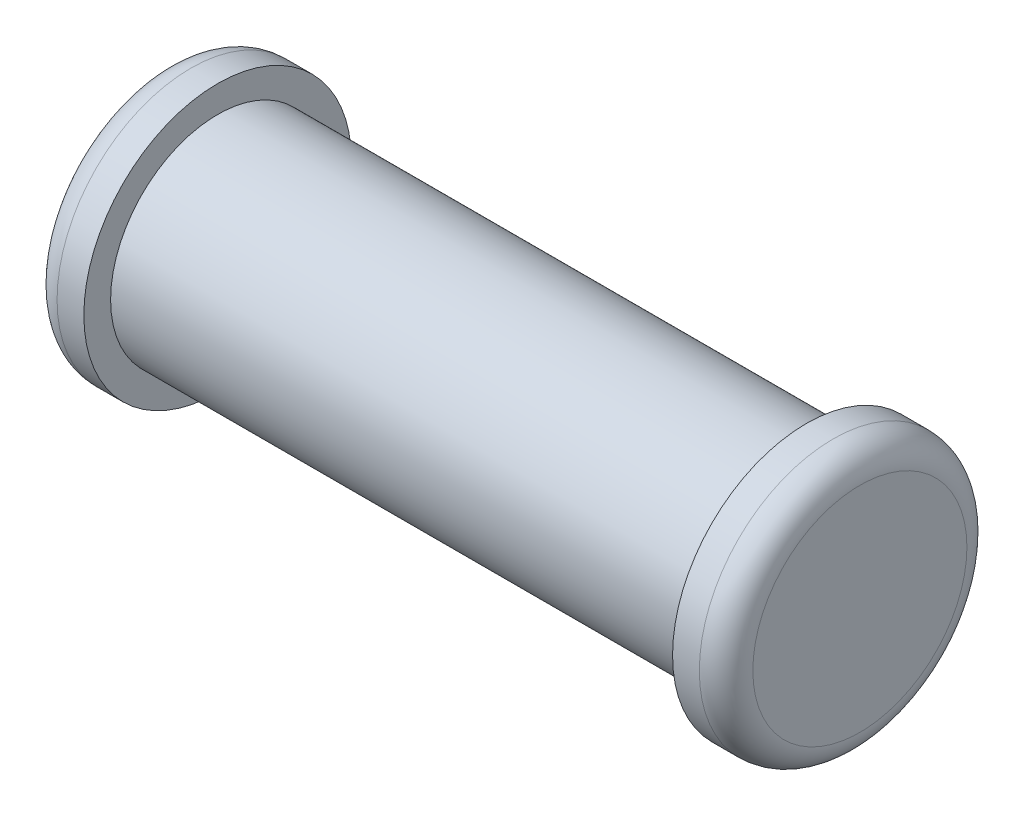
ISO-10303-21;
HEADER;
FILE_DESCRIPTION(('STEP AP214'),'2;1');
FILE_NAME('part.step','',(''),(''),'','','');
FILE_SCHEMA(('AUTOMOTIVE_DESIGN { 1 0 10303 214 1 1 1 1 }'));
ENDSEC;
DATA;
#1=APPLICATION_CONTEXT('core data for automotive mechanical design processes');
#2=APPLICATION_PROTOCOL_DEFINITION('international standard','automotive_design',2000,#1);
#3=PRODUCT_CONTEXT('',#1,'mechanical');
#4=PRODUCT('Part','Part','',(#3));
#5=PRODUCT_RELATED_PRODUCT_CATEGORY('part','',(#4));
#6=PRODUCT_DEFINITION_FORMATION('','',#4);
#7=PRODUCT_DEFINITION_CONTEXT('part definition',#1,'design');
#8=PRODUCT_DEFINITION('design','',#6,#7);
#9=PRODUCT_DEFINITION_SHAPE('','',#8);
#10=(LENGTH_UNIT() NAMED_UNIT(*) SI_UNIT(.MILLI.,.METRE.));
#11=(NAMED_UNIT(*) PLANE_ANGLE_UNIT() SI_UNIT($,.RADIAN.));
#12=(NAMED_UNIT(*) SI_UNIT($,.STERADIAN.) SOLID_ANGLE_UNIT());
#13=UNCERTAINTY_MEASURE_WITH_UNIT(LENGTH_MEASURE(1.E-05),#10,'distance_accuracy_value','');
#14=(GEOMETRIC_REPRESENTATION_CONTEXT(3) GLOBAL_UNCERTAINTY_ASSIGNED_CONTEXT((#13)) GLOBAL_UNIT_ASSIGNED_CONTEXT((#10,
#11,#12)) REPRESENTATION_CONTEXT('',''));
#15=CARTESIAN_POINT('',(0.,0.,0.));
#16=DIRECTION('',(0.,0.,1.));
#17=DIRECTION('',(1.,0.,0.));
#18=AXIS2_PLACEMENT_3D('',#15,#16,#17);
#19=CARTESIAN_POINT('',(11.,0.,0.));
#20=DIRECTION('',(-1.,0.,0.));
#21=DIRECTION('',(0.,0.,1.));
#22=AXIS2_PLACEMENT_3D('',#19,#20,#21);
#23=CYLINDRICAL_SURFACE('',#22,2.);
#24=CARTESIAN_POINT('',(11.,0.,0.));
#25=DIRECTION('',(1.,0.,0.));
#26=DIRECTION('',(0.,0.,-1.));
#27=AXIS2_PLACEMENT_3D('',#24,#25,#26);
#28=CIRCLE('',#27,2.);
#29=CARTESIAN_POINT('',(11.,0.,-2.));
#30=VERTEX_POINT('',#29);
#31=EDGE_CURVE('E61',#30,#30,#28,.T.);
#32=ORIENTED_EDGE('',*,*,#31,.F.);
#33=EDGE_LOOP('',(#32));
#34=FACE_BOUND('',#33,.T.);
#35=CARTESIAN_POINT('',(0.,0.,0.));
#36=DIRECTION('',(1.,0.,0.));
#37=DIRECTION('',(0.,0.,-1.));
#38=AXIS2_PLACEMENT_3D('',#35,#36,#37);
#39=CIRCLE('',#38,2.);
#40=CARTESIAN_POINT('',(0.,0.,-2.));
#41=VERTEX_POINT('',#40);
#42=EDGE_CURVE('E62',#41,#41,#39,.T.);
#43=ORIENTED_EDGE('',*,*,#42,.T.);
#44=EDGE_LOOP('',(#43));
#45=FACE_BOUND('',#44,.T.);
#46=ADVANCED_FACE('F41',(#34,#45),#23,.T.);
#47=CARTESIAN_POINT('',(-1.,0.,0.));
#48=DIRECTION('',(1.,0.,0.));
#49=DIRECTION('',(0.,0.,-1.));
#50=AXIS2_PLACEMENT_3D('',#47,#48,#49);
#51=CYLINDRICAL_SURFACE('',#50,2.5);
#52=CARTESIAN_POINT('',(-0.5,0.,0.));
#53=DIRECTION('',(-1.,0.,0.));
#54=DIRECTION('',(0.,0.,1.));
#55=AXIS2_PLACEMENT_3D('',#52,#53,#54);
#56=CIRCLE('',#55,2.5);
#57=CARTESIAN_POINT('',(-0.5,0.,2.5));
#58=VERTEX_POINT('',#57);
#59=EDGE_CURVE('E52',#58,#58,#56,.F.);
#60=ORIENTED_EDGE('',*,*,#59,.T.);
#61=EDGE_LOOP('',(#60));
#62=FACE_BOUND('',#61,.T.);
#63=CARTESIAN_POINT('',(0.,0.,0.));
#64=DIRECTION('',(-1.,0.,0.));
#65=DIRECTION('',(0.,0.,1.));
#66=AXIS2_PLACEMENT_3D('',#63,#64,#65);
#67=CIRCLE('',#66,2.5);
#68=CARTESIAN_POINT('',(0.,0.,2.5));
#69=VERTEX_POINT('',#68);
#70=EDGE_CURVE('E65',#69,#69,#67,.T.);
#71=ORIENTED_EDGE('',*,*,#70,.T.);
#72=EDGE_LOOP('',(#71));
#73=FACE_BOUND('',#72,.T.);
#74=ADVANCED_FACE('F91',(#62,#73),#51,.T.);
#75=CARTESIAN_POINT('',(-1.,0.,0.));
#76=DIRECTION('',(-1.,0.,0.));
#77=DIRECTION('',(0.,0.,1.));
#78=AXIS2_PLACEMENT_3D('',#75,#76,#77);
#79=PLANE('',#78);
#80=CARTESIAN_POINT('',(-1.,0.,0.));
#81=DIRECTION('',(-1.,0.,0.));
#82=DIRECTION('',(0.,0.,1.));
#83=AXIS2_PLACEMENT_3D('',#80,#81,#82);
#84=CIRCLE('',#83,2.);
#85=CARTESIAN_POINT('',(-1.,0.,2.));
#86=VERTEX_POINT('',#85);
#87=EDGE_CURVE('E56',#86,#86,#84,.T.);
#88=ORIENTED_EDGE('',*,*,#87,.T.);
#89=EDGE_LOOP('',(#88));
#90=FACE_BOUND('',#89,.T.);
#91=ADVANCED_FACE('F98',(#90),#79,.T.);
#92=CARTESIAN_POINT('',(0.,0.,0.));
#93=DIRECTION('',(-1.,0.,0.));
#94=DIRECTION('',(0.,0.,1.));
#95=AXIS2_PLACEMENT_3D('',#92,#93,#94);
#96=PLANE('',#95);
#97=ORIENTED_EDGE('',*,*,#42,.F.);
#98=EDGE_LOOP('',(#97));
#99=FACE_BOUND('',#98,.T.);
#100=ORIENTED_EDGE('',*,*,#70,.F.);
#101=EDGE_LOOP('',(#100));
#102=FACE_BOUND('',#101,.T.);
#103=ADVANCED_FACE('F86',(#99,#102),#96,.F.);
#104=CARTESIAN_POINT('',(-0.5,0.,0.));
#105=DIRECTION('',(-1.,0.,0.));
#106=DIRECTION('',(0.,0.,1.));
#107=AXIS2_PLACEMENT_3D('',#104,#105,#106);
#108=TOROIDAL_SURFACE('',#107,2.,0.5);
#109=ORIENTED_EDGE('',*,*,#59,.F.);
#110=EDGE_LOOP('',(#109));
#111=FACE_BOUND('',#110,.T.);
#112=ORIENTED_EDGE('',*,*,#87,.F.);
#113=EDGE_LOOP('',(#112));
#114=FACE_BOUND('',#113,.T.);
#115=ADVANCED_FACE('F79',(#111,#114),#108,.T.);
#116=CARTESIAN_POINT('',(12.,0.,0.));
#117=DIRECTION('',(-1.,0.,0.));
#118=DIRECTION('',(0.,0.,1.));
#119=AXIS2_PLACEMENT_3D('',#116,#117,#118);
#120=CYLINDRICAL_SURFACE('',#119,2.5);
#121=CARTESIAN_POINT('',(11.5,0.,0.));
#122=DIRECTION('',(1.,0.,0.));
#123=DIRECTION('',(0.,0.,-1.));
#124=AXIS2_PLACEMENT_3D('',#121,#122,#123);
#125=CIRCLE('',#124,2.5);
#126=CARTESIAN_POINT('',(11.5,0.,-2.5));
#127=VERTEX_POINT('',#126);
#128=EDGE_CURVE('E48',#127,#127,#125,.F.);
#129=ORIENTED_EDGE('',*,*,#128,.T.);
#130=EDGE_LOOP('',(#129));
#131=FACE_BOUND('',#130,.T.);
#132=CARTESIAN_POINT('',(11.,0.,0.));
#133=DIRECTION('',(-1.,0.,0.));
#134=DIRECTION('',(0.,0.,1.));
#135=AXIS2_PLACEMENT_3D('',#132,#133,#134);
#136=CIRCLE('',#135,2.5);
#137=CARTESIAN_POINT('',(11.,0.,2.5));
#138=VERTEX_POINT('',#137);
#139=EDGE_CURVE('E70',#138,#138,#136,.T.);
#140=ORIENTED_EDGE('',*,*,#139,.F.);
#141=EDGE_LOOP('',(#140));
#142=FACE_BOUND('',#141,.T.);
#143=ADVANCED_FACE('F76',(#131,#142),#120,.T.);
#144=CARTESIAN_POINT('',(12.,0.,0.));
#145=DIRECTION('',(1.,0.,0.));
#146=DIRECTION('',(0.,0.,1.));
#147=AXIS2_PLACEMENT_3D('',#144,#145,#146);
#148=PLANE('',#147);
#149=CARTESIAN_POINT('',(12.,0.,0.));
#150=DIRECTION('',(1.,0.,0.));
#151=DIRECTION('',(0.,0.,-1.));
#152=AXIS2_PLACEMENT_3D('',#149,#150,#151);
#153=CIRCLE('',#152,2.);
#154=CARTESIAN_POINT('',(12.,0.,-2.));
#155=VERTEX_POINT('',#154);
#156=EDGE_CURVE('E10',#155,#155,#153,.T.);
#157=ORIENTED_EDGE('',*,*,#156,.T.);
#158=EDGE_LOOP('',(#157));
#159=FACE_BOUND('',#158,.T.);
#160=ADVANCED_FACE('F78',(#159),#148,.T.);
#161=CARTESIAN_POINT('',(11.,0.,0.));
#162=DIRECTION('',(1.,0.,0.));
#163=DIRECTION('',(0.,0.,1.));
#164=AXIS2_PLACEMENT_3D('',#161,#162,#163);
#165=PLANE('',#164);
#166=ORIENTED_EDGE('',*,*,#31,.T.);
#167=EDGE_LOOP('',(#166));
#168=FACE_BOUND('',#167,.T.);
#169=ORIENTED_EDGE('',*,*,#139,.T.);
#170=EDGE_LOOP('',(#169));
#171=FACE_BOUND('',#170,.T.);
#172=ADVANCED_FACE('F74',(#168,#171),#165,.F.);
#173=CARTESIAN_POINT('',(11.5,0.,0.));
#174=DIRECTION('',(1.,0.,0.));
#175=DIRECTION('',(0.,0.,-1.));
#176=AXIS2_PLACEMENT_3D('',#173,#174,#175);
#177=TOROIDAL_SURFACE('',#176,2.,0.5);
#178=ORIENTED_EDGE('',*,*,#156,.F.);
#179=EDGE_LOOP('',(#178));
#180=FACE_BOUND('',#179,.T.);
#181=ORIENTED_EDGE('',*,*,#128,.F.);
#182=EDGE_LOOP('',(#181));
#183=FACE_BOUND('',#182,.T.);
#184=ADVANCED_FACE('F43',(#180,#183),#177,.T.);
#185=CLOSED_SHELL('',(#46,#74,#91,#103,#115,#143,#160,#172,#184));
#186=MANIFOLD_SOLID_BREP('B2',#185);
#187=ADVANCED_BREP_SHAPE_REPRESENTATION('',(#18,#186),#14);
#188=SHAPE_DEFINITION_REPRESENTATION(#9,#187);
ENDSEC;
END-ISO-10303-21;
